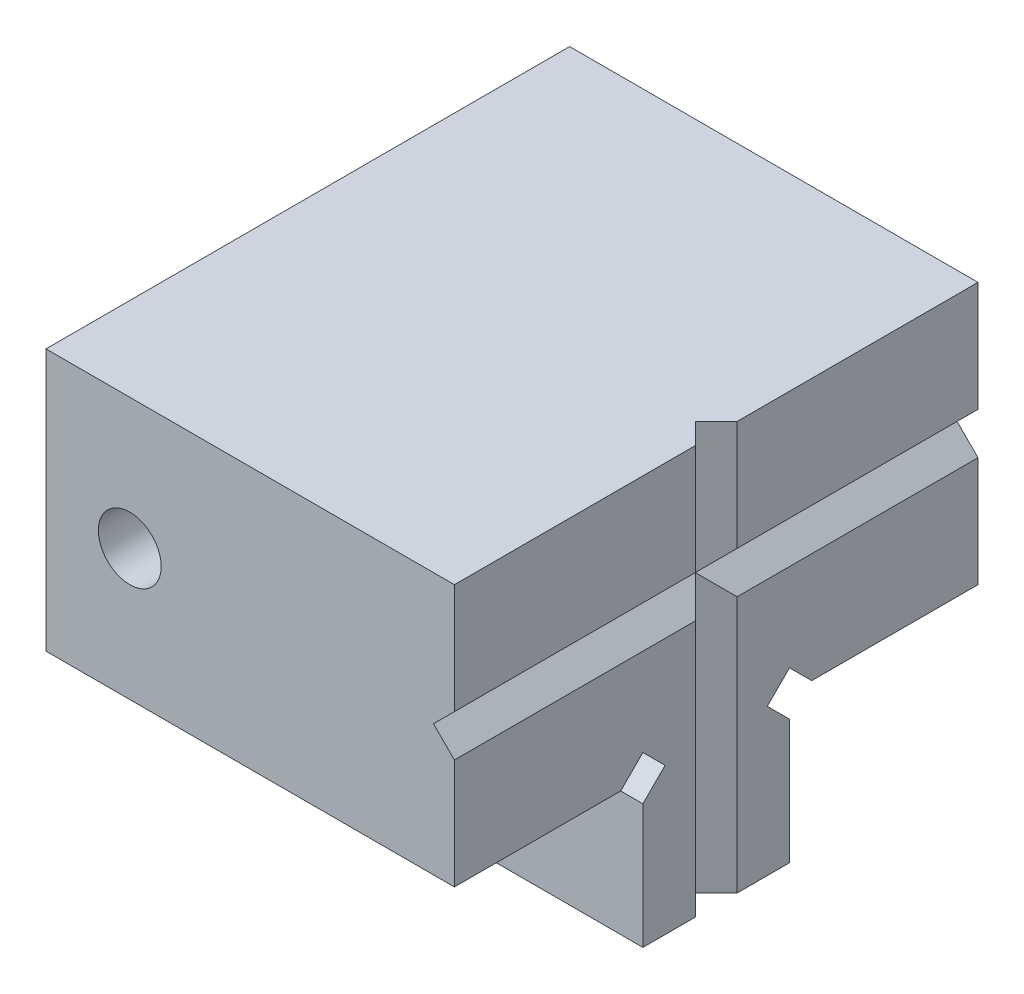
ISO-10303-21;
HEADER;
FILE_DESCRIPTION(('STEP AP214'),'2;1');
FILE_NAME('part.step','',(''),(''),'','','');
FILE_SCHEMA(('AUTOMOTIVE_DESIGN { 1 0 10303 214 1 1 1 1 }'));
ENDSEC;
DATA;
#1=APPLICATION_CONTEXT('core data for automotive mechanical design processes');
#2=APPLICATION_PROTOCOL_DEFINITION('international standard','automotive_design',2000,#1);
#3=PRODUCT_CONTEXT('',#1,'mechanical');
#4=PRODUCT('Part','Part','',(#3));
#5=PRODUCT_RELATED_PRODUCT_CATEGORY('part','',(#4));
#6=PRODUCT_DEFINITION_FORMATION('','',#4);
#7=PRODUCT_DEFINITION_CONTEXT('part definition',#1,'design');
#8=PRODUCT_DEFINITION('design','',#6,#7);
#9=PRODUCT_DEFINITION_SHAPE('','',#8);
#10=(LENGTH_UNIT() NAMED_UNIT(*) SI_UNIT(.MILLI.,.METRE.));
#11=(NAMED_UNIT(*) PLANE_ANGLE_UNIT() SI_UNIT($,.RADIAN.));
#12=(NAMED_UNIT(*) SI_UNIT($,.STERADIAN.) SOLID_ANGLE_UNIT());
#13=UNCERTAINTY_MEASURE_WITH_UNIT(LENGTH_MEASURE(1.E-05),#10,'distance_accuracy_value','');
#14=(GEOMETRIC_REPRESENTATION_CONTEXT(3) GLOBAL_UNCERTAINTY_ASSIGNED_CONTEXT((#13)) GLOBAL_UNIT_ASSIGNED_CONTEXT((#10,
#11,#12)) REPRESENTATION_CONTEXT('',''));
#15=CARTESIAN_POINT('',(0.,0.,0.));
#16=DIRECTION('',(0.,0.,1.));
#17=DIRECTION('',(1.,0.,0.));
#18=AXIS2_PLACEMENT_3D('',#15,#16,#17);
#19=CARTESIAN_POINT('',(-31.,26.5,25.));
#20=DIRECTION('',(0.,0.,-1.));
#21=DIRECTION('',(0.,1.,0.));
#22=AXIS2_PLACEMENT_3D('',#19,#20,#21);
#23=CYLINDRICAL_SURFACE('',#22,2.99999999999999);
#24=CARTESIAN_POINT('',(-31.,29.5,5.19615242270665));
#25=CARTESIAN_POINT('',(-30.9217997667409,29.4999991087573,5.19615338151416));
#26=CARTESIAN_POINT('',(-30.8435900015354,29.4969361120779,5.19792581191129));
#27=CARTESIAN_POINT('',(-30.6877919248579,29.484735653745,5.20493931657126));
#28=CARTESIAN_POINT('',(-30.6102039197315,29.4755953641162,5.21018200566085));
#29=CARTESIAN_POINT('',(-30.3790559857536,29.4391691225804,5.2308820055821));
#30=CARTESIAN_POINT('',(-30.2272490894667,29.402878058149,5.25131076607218));
#31=CARTESIAN_POINT('',(-29.9336083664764,29.3082999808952,5.30247746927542));
#32=CARTESIAN_POINT('',(-29.7917261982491,29.2501298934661,5.33316051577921));
#33=CARTESIAN_POINT('',(-29.5197372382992,29.1138025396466,5.40128072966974));
#34=CARTESIAN_POINT('',(-29.3896310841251,29.0356441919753,5.43871826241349));
#35=CARTESIAN_POINT('',(-29.1330798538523,28.8539996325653,5.5199058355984));
#36=CARTESIAN_POINT('',(-29.0078217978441,28.7489561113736,5.56392184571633));
#37=CARTESIAN_POINT('',(-28.7757756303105,28.5197614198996,5.65115954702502));
#38=CARTESIAN_POINT('',(-28.6689967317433,28.3956007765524,5.69438083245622));
#39=CARTESIAN_POINT('',(-28.4698983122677,28.1214686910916,5.77864428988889));
#40=CARTESIAN_POINT('',(-28.3790386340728,27.9703215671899,5.81934318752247));
#41=CARTESIAN_POINT('',(-28.2245775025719,27.6524710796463,5.89052268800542));
#42=CARTESIAN_POINT('',(-28.1609588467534,27.485777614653,5.92100973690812));
#43=CARTESIAN_POINT('',(-28.0674860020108,27.1541348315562,5.96641383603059));
#44=CARTESIAN_POINT('',(-28.035551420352,26.9899053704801,5.98228440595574));
#45=CARTESIAN_POINT('',(-27.999501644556,26.6577118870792,6.00022751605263));
#46=CARTESIAN_POINT('',(-27.9953696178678,26.4897501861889,6.00230840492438));
#47=CARTESIAN_POINT('',(-28.0142400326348,26.170502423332,5.9928894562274));
#48=CARTESIAN_POINT('',(-28.0349140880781,26.0190363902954,5.98255487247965));
#49=CARTESIAN_POINT('',(-28.0986424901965,25.7220586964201,5.9512273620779));
#50=CARTESIAN_POINT('',(-28.1416985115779,25.5765474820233,5.93023363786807));
#51=CARTESIAN_POINT('',(-28.2492478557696,25.2930717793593,5.87914748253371));
#52=CARTESIAN_POINT('',(-28.3140295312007,25.1552395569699,5.84893318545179));
#53=CARTESIAN_POINT('',(-28.462789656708,24.8920697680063,5.78212944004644));
#54=CARTESIAN_POINT('',(-28.5467749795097,24.766736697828,5.74553771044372));
#55=CARTESIAN_POINT('',(-28.7406884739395,24.5194783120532,5.665331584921));
#56=CARTESIAN_POINT('',(-28.8523185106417,24.3989950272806,5.62138031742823));
#57=CARTESIAN_POINT('',(-29.0937597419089,24.177689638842,5.53363118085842));
#58=CARTESIAN_POINT('',(-29.2235847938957,24.0768826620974,5.48983345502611));
#59=CARTESIAN_POINT('',(-29.5079821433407,23.8914730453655,5.40432084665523));
#60=CARTESIAN_POINT('',(-29.663602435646,23.808305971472,5.36291485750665));
#61=CARTESIAN_POINT('',(-29.9075630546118,23.704571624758,5.30915194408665));
#62=CARTESIAN_POINT('',(-29.9906563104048,23.67349202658,5.29261946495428));
#63=CARTESIAN_POINT('',(-30.1598086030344,23.6186870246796,5.26298473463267));
#64=CARTESIAN_POINT('',(-30.2458657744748,23.5949570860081,5.24988036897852));
#65=CARTESIAN_POINT('',(-30.413371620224,23.5567607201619,5.22855455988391));
#66=CARTESIAN_POINT('',(-30.4946494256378,23.5417118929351,5.22002982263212));
#67=CARTESIAN_POINT('',(-30.6584352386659,23.5183609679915,5.20672737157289));
#68=CARTESIAN_POINT('',(-30.7409425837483,23.5100553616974,5.20194770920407));
#69=CARTESIAN_POINT('',(-30.9064710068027,23.5003133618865,5.19633662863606));
#70=CARTESIAN_POINT('',(-30.9894918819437,23.4988744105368,5.1955037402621));
#71=CARTESIAN_POINT('',(-31.1552864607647,23.5028725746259,5.19780953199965));
#72=CARTESIAN_POINT('',(-31.2380601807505,23.508309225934,5.20094794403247));
#73=CARTESIAN_POINT('',(-31.4668591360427,23.5328986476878,5.21504493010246));
#74=CARTESIAN_POINT('',(-31.6119108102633,23.5594383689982,5.23019160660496));
#75=CARTESIAN_POINT('',(-31.8951309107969,23.6329093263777,5.27081666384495));
#76=CARTESIAN_POINT('',(-32.0332970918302,23.6798471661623,5.29629839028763));
#77=CARTESIAN_POINT('',(-32.3062261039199,23.7950577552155,5.3560878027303));
#78=CARTESIAN_POINT('',(-32.4405349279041,23.8642179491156,5.39074960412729));
#79=CARTESIAN_POINT('',(-32.696409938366,24.0211386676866,5.46468327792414));
#80=CARTESIAN_POINT('',(-32.8179695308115,24.1089087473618,5.50395751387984));
#81=CARTESIAN_POINT('',(-33.0609356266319,24.313488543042,5.588640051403));
#82=CARTESIAN_POINT('',(-33.1803912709,24.432564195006,5.63419752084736));
#83=CARTESIAN_POINT('',(-33.3982368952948,24.6897865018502,5.72202702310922));
#84=CARTESIAN_POINT('',(-33.4966197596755,24.8279395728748,5.76429794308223));
#85=CARTESIAN_POINT('',(-33.6717211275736,25.1243939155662,5.84224085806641));
#86=CARTESIAN_POINT('',(-33.7477993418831,25.2831307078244,5.87770925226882));
#87=CARTESIAN_POINT('',(-33.8714137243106,25.6134329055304,5.93650064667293));
#88=CARTESIAN_POINT('',(-33.9189749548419,25.784986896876,5.95983430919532));
#89=CARTESIAN_POINT('',(-33.9801056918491,26.1190609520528,5.9900252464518));
#90=CARTESIAN_POINT('',(-33.9963936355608,26.2809656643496,5.99819783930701));
#91=CARTESIAN_POINT('',(-34.0025297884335,26.6053779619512,6.00126390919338));
#92=CARTESIAN_POINT('',(-33.9923872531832,26.7678853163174,5.99616203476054));
#93=CARTESIAN_POINT('',(-33.9477508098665,27.0776139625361,5.97401907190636));
#94=CARTESIAN_POINT('',(-33.9149055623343,27.2251369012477,5.95778686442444));
#95=CARTESIAN_POINT('',(-33.8280188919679,27.5123379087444,5.91576278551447));
#96=CARTESIAN_POINT('',(-33.7739744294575,27.6520148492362,5.88996954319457));
#97=CARTESIAN_POINT('',(-33.6438192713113,27.9262700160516,5.82977801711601));
#98=CARTESIAN_POINT('',(-33.5668636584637,28.0603746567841,5.79505887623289));
#99=CARTESIAN_POINT('',(-33.3941245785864,28.314324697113,5.72064363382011));
#100=CARTESIAN_POINT('',(-33.2983324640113,28.4341635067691,5.68094524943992));
#101=CARTESIAN_POINT('',(-33.0796152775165,28.6687388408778,5.59585978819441));
#102=CARTESIAN_POINT('',(-32.9549386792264,28.7817806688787,5.5502997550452));
#103=CARTESIAN_POINT('',(-32.6876216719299,28.9860022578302,5.46188649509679));
#104=CARTESIAN_POINT('',(-32.5449655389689,29.077162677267,5.41903568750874));
#105=CARTESIAN_POINT('',(-32.3174682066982,29.1966555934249,5.36004774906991));
#106=CARTESIAN_POINT('',(-32.2380241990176,29.2340540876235,5.34101219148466));
#107=CARTESIAN_POINT('',(-32.0756467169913,29.301912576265,5.30572783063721));
#108=CARTESIAN_POINT('',(-31.992715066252,29.3323761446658,5.28947759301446));
#109=CARTESIAN_POINT('',(-31.8241552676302,29.3859262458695,5.26045215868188));
#110=CARTESIAN_POINT('',(-31.7385346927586,29.4090317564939,5.24766803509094));
#111=CARTESIAN_POINT('',(-31.5651447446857,29.4476242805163,5.22608869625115));
#112=CARTESIAN_POINT('',(-31.4773769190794,29.4631166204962,5.21729069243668));
#113=CARTESIAN_POINT('',(-31.3246011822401,29.4830938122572,5.20588528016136));
#114=CARTESIAN_POINT('',(-31.259905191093,29.4894274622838,5.20224442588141));
#115=CARTESIAN_POINT('',(-31.1301416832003,29.4978810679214,5.19737751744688));
#116=CARTESIAN_POINT('',(-31.0650741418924,29.5000007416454,5.19615162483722));
#117=CARTESIAN_POINT('',(-31.,29.5,5.19615242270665));
#118=B_SPLINE_CURVE_WITH_KNOTS('',3,(#24,#25,#26,#27,#28,#29,#30,#31,#32,#33,#34,#35,#36,#37,
#38,#39,#40,#41,#42,#43,#44,#45,#46,#47,#48,#49,#50,#51,#52,#53,#54,#55,#56,#57,#58,#59,#60,#61,
#62,#63,#64,#65,#66,#67,#68,#69,#70,#71,#72,#73,#74,#75,#76,#77,#78,#79,#80,#81,#82,#83,#84,#85,
#86,#87,#88,#89,#90,#91,#92,#93,#94,#95,#96,#97,#98,#99,#100,#101,#102,#103,#104,#105,#106,#107,
#108,#109,#110,#111,#112,#113,#114,#115,#116,#117),.UNSPECIFIED.,.T.,.F.,(4,2,2,2,2,2,2,2,2,2,2,
2,2,2,2,2,2,2,2,2,2,2,2,2,2,2,2,2,2,2,2,2,2,2,2,2,2,2,2,2,2,2,2,2,2,2,4),(0.,0.234529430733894,
0.469168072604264,0.938850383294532,1.40605749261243,1.87328988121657,2.37905864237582,
2.88507883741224,3.42520847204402,3.96499651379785,4.46637625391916,4.9674524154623,
5.42495462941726,5.88249108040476,6.34635774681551,6.81039068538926,7.31828744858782,
7.82657315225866,8.36713695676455,8.63752916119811,8.90775419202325,9.1566960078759,
9.40550821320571,9.65422772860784,9.90293045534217,10.3454331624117,10.7880792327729,
11.2512265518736,11.7146122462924,12.2364099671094,12.758383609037,13.2941331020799,
13.8294110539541,14.3155757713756,14.8015702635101,15.2555404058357,15.7095756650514,
16.1830301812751,16.6567025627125,17.177514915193,17.6987859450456,17.9680115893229,
18.2370981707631,18.5054849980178,18.7736837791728,18.9688338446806,19.1639969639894),.UNSPECIFIED.);
#119=CARTESIAN_POINT('',(-31.,29.5,5.19615242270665));
#120=VERTEX_POINT('',#119);
#121=EDGE_CURVE('E41',#120,#120,#118,.T.);
#122=ORIENTED_EDGE('',*,*,#121,.T.);
#123=EDGE_LOOP('',(#122));
#124=FACE_BOUND('',#123,.T.);
#125=CARTESIAN_POINT('',(-31.,26.5,25.));
#126=DIRECTION('',(0.,0.,-1.));
#127=DIRECTION('',(0.,1.,0.));
#128=AXIS2_PLACEMENT_3D('',#125,#126,#127);
#129=CIRCLE('',#128,2.99999999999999);
#130=CARTESIAN_POINT('',(-31.,29.5,25.));
#131=VERTEX_POINT('',#130);
#132=EDGE_CURVE('E230',#131,#131,#129,.T.);
#133=ORIENTED_EDGE('',*,*,#132,.F.);
#134=EDGE_LOOP('',(#133));
#135=FACE_BOUND('',#134,.T.);
#136=ADVANCED_FACE('F37',(#124,#135),#23,.F.);
#137=CARTESIAN_POINT('',(0.,0.,0.));
#138=DIRECTION('',(-1.,0.,0.));
#139=DIRECTION('',(0.,0.,1.));
#140=AXIS2_PLACEMENT_3D('',#137,#138,#139);
#141=PLANE('',#140);
#142=DIRECTION('',(0.,0.,1.));
#143=VECTOR('',#142,1.);
#144=CARTESIAN_POINT('',(0.,24.5,-25.));
#145=LINE('',#144,#143);
#146=CARTESIAN_POINT('',(0.,24.5,-25.));
#147=VERTEX_POINT('',#146);
#148=CARTESIAN_POINT('',(0.,24.5,-2.));
#149=VERTEX_POINT('',#148);
#150=EDGE_CURVE('E259',#147,#149,#145,.T.);
#151=ORIENTED_EDGE('',*,*,#150,.T.);
#152=DIRECTION('',(0.,1.,0.));
#153=VECTOR('',#152,1.);
#154=CARTESIAN_POINT('',(0.,0.,-2.));
#155=LINE('',#154,#153);
#156=CARTESIAN_POINT('',(0.,0.,-2.));
#157=VERTEX_POINT('',#156);
#158=EDGE_CURVE('E232',#157,#149,#155,.T.);
#159=ORIENTED_EDGE('',*,*,#158,.F.);
#160=DIRECTION('',(0.,0.,-1.));
#161=VECTOR('',#160,1.);
#162=CARTESIAN_POINT('',(0.,0.,7.));
#163=LINE('',#162,#161);
#164=CARTESIAN_POINT('',(0.,0.,-7.));
#165=VERTEX_POINT('',#164);
#166=EDGE_CURVE('E220',#157,#165,#163,.T.);
#167=ORIENTED_EDGE('',*,*,#166,.T.);
#168=DIRECTION('',(0.,1.,0.));
#169=VECTOR('',#168,1.);
#170=CARTESIAN_POINT('',(0.,0.,-7.));
#171=LINE('',#170,#169);
#172=CARTESIAN_POINT('',(0.,11.8786796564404,-7.));
#173=VERTEX_POINT('',#172);
#174=EDGE_CURVE('E334',#165,#173,#171,.T.);
#175=ORIENTED_EDGE('',*,*,#174,.T.);
#176=DIRECTION('',(0.,0.707106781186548,0.707106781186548));
#177=VECTOR('',#176,1.);
#178=CARTESIAN_POINT('',(0.,11.8786796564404,-7.));
#179=LINE('',#178,#177);
#180=CARTESIAN_POINT('',(0.,14.,-4.87867965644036));
#181=VERTEX_POINT('',#180);
#182=EDGE_CURVE('E337',#173,#181,#179,.T.);
#183=ORIENTED_EDGE('',*,*,#182,.T.);
#184=DIRECTION('',(0.,0.707106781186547,-0.707106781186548));
#185=VECTOR('',#184,1.);
#186=CARTESIAN_POINT('',(0.,14.,-4.87867965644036));
#187=LINE('',#186,#185);
#188=CARTESIAN_POINT('',(0.,16.1213203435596,-7.));
#189=VERTEX_POINT('',#188);
#190=EDGE_CURVE('E340',#181,#189,#187,.T.);
#191=ORIENTED_EDGE('',*,*,#190,.T.);
#192=DIRECTION('',(0.,-0.707106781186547,-0.707106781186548));
#193=VECTOR('',#192,1.);
#194=CARTESIAN_POINT('',(0.,16.1213203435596,-7.));
#195=LINE('',#194,#193);
#196=CARTESIAN_POINT('',(0.,14.,-9.12132034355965));
#197=VERTEX_POINT('',#196);
#198=EDGE_CURVE('E343',#189,#197,#195,.T.);
#199=ORIENTED_EDGE('',*,*,#198,.T.);
#200=DIRECTION('',(0.,0.,-1.));
#201=VECTOR('',#200,1.);
#202=CARTESIAN_POINT('',(0.,14.,-9.12132034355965));
#203=LINE('',#202,#201);
#204=CARTESIAN_POINT('',(0.,14.,-25.));
#205=VERTEX_POINT('',#204);
#206=EDGE_CURVE('E266',#197,#205,#203,.T.);
#207=ORIENTED_EDGE('',*,*,#206,.T.);
#208=DIRECTION('',(0.,1.,0.));
#209=VECTOR('',#208,1.);
#210=CARTESIAN_POINT('',(0.,14.,-25.));
#211=LINE('',#210,#209);
#212=EDGE_CURVE('E306',#205,#147,#211,.T.);
#213=ORIENTED_EDGE('',*,*,#212,.T.);
#214=EDGE_LOOP('',(#151,#159,#167,#175,#183,#191,#199,#207,#213));
#215=FACE_BOUND('',#214,.T.);
#216=ADVANCED_FACE('F409',(#215),#141,.F.);
#217=DIRECTION('',(0.,0.,1.));
#218=VECTOR('',#217,1.);
#219=CARTESIAN_POINT('',(0.,39.,25.));
#220=LINE('',#219,#218);
#221=CARTESIAN_POINT('',(0.,39.,-25.));
#222=VERTEX_POINT('',#221);
#223=CARTESIAN_POINT('',(0.,39.,-2.));
#224=VERTEX_POINT('',#223);
#225=EDGE_CURVE('E310',#222,#224,#220,.T.);
#226=ORIENTED_EDGE('',*,*,#225,.T.);
#227=CARTESIAN_POINT('',(0.,28.5,-2.));
#228=VERTEX_POINT('',#227);
#229=EDGE_CURVE('E235',#228,#224,#155,.T.);
#230=ORIENTED_EDGE('',*,*,#229,.F.);
#231=DIRECTION('',(0.,0.,1.));
#232=VECTOR('',#231,1.);
#233=CARTESIAN_POINT('',(0.,28.5,-25.));
#234=LINE('',#233,#232);
#235=CARTESIAN_POINT('',(0.,28.5,-25.));
#236=VERTEX_POINT('',#235);
#237=EDGE_CURVE('E256',#236,#228,#234,.T.);
#238=ORIENTED_EDGE('',*,*,#237,.F.);
#239=EDGE_CURVE('E254',#236,#222,#211,.T.);
#240=ORIENTED_EDGE('',*,*,#239,.T.);
#241=EDGE_LOOP('',(#226,#230,#238,#240));
#242=FACE_BOUND('',#241,.T.);
#243=ADVANCED_FACE('F414',(#242),#141,.F.);
#244=CARTESIAN_POINT('',(-2.00000000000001,26.5,-25.));
#245=DIRECTION('',(-0.707106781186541,-0.707106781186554,0.));
#246=DIRECTION('',(0.707106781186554,-0.707106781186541,0.));
#247=AXIS2_PLACEMENT_3D('',#244,#245,#246);
#248=PLANE('',#247);
#249=DIRECTION('',(0.,0.,1.));
#250=VECTOR('',#249,1.);
#251=CARTESIAN_POINT('',(-2.00000000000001,26.5,-25.));
#252=LINE('',#251,#250);
#253=CARTESIAN_POINT('',(-2.00000000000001,26.5,-25.));
#254=VERTEX_POINT('',#253);
#255=CARTESIAN_POINT('',(-2.00000000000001,26.5,0.));
#256=VERTEX_POINT('',#255);
#257=EDGE_CURVE('E251',#254,#256,#252,.T.);
#258=ORIENTED_EDGE('',*,*,#257,.T.);
#259=DIRECTION('',(0.577350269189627,-0.577350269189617,-0.577350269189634));
#260=VECTOR('',#259,1.);
#261=CARTESIAN_POINT('',(6.33333333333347,18.1666666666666,-8.33333333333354));
#262=LINE('',#261,#260);
#263=EDGE_CURVE('E204',#256,#149,#262,.T.);
#264=ORIENTED_EDGE('',*,*,#263,.T.);
#265=ORIENTED_EDGE('',*,*,#150,.F.);
#266=DIRECTION('',(0.707106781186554,-0.707106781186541,0.));
#267=VECTOR('',#266,1.);
#268=CARTESIAN_POINT('',(-2.00000000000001,26.5,-25.));
#269=LINE('',#268,#267);
#270=EDGE_CURVE('E241',#254,#147,#269,.T.);
#271=ORIENTED_EDGE('',*,*,#270,.F.);
#272=EDGE_LOOP('',(#258,#264,#265,#271));
#273=FACE_BOUND('',#272,.T.);
#274=ADVANCED_FACE('F577',(#273),#248,.F.);
#275=CARTESIAN_POINT('',(0.,28.5,-25.));
#276=DIRECTION('',(-0.707106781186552,0.707106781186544,0.));
#277=DIRECTION('',(-0.707106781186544,-0.707106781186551,0.));
#278=AXIS2_PLACEMENT_3D('',#275,#276,#277);
#279=PLANE('',#278);
#280=ORIENTED_EDGE('',*,*,#237,.T.);
#281=DIRECTION('',(-0.577350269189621,-0.577350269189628,0.577350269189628));
#282=VECTOR('',#281,1.);
#283=CARTESIAN_POINT('',(7.66666666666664,36.1666666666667,-9.66666666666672));
#284=LINE('',#283,#282);
#285=EDGE_CURVE('E11',#228,#256,#284,.T.);
#286=ORIENTED_EDGE('',*,*,#285,.T.);
#287=ORIENTED_EDGE('',*,*,#257,.F.);
#288=DIRECTION('',(-0.707106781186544,-0.707106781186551,0.));
#289=VECTOR('',#288,1.);
#290=CARTESIAN_POINT('',(0.,28.5,-25.));
#291=LINE('',#290,#289);
#292=EDGE_CURVE('E67',#236,#254,#291,.T.);
#293=ORIENTED_EDGE('',*,*,#292,.F.);
#294=EDGE_LOOP('',(#280,#286,#287,#293));
#295=FACE_BOUND('',#294,.T.);
#296=ADVANCED_FACE('F565',(#295),#279,.F.);
#297=CARTESIAN_POINT('',(0.,0.,7.));
#298=VERTEX_POINT('',#297);
#299=CARTESIAN_POINT('',(0.,0.,2.));
#300=VERTEX_POINT('',#299);
#301=EDGE_CURVE('E332',#298,#300,#163,.T.);
#302=ORIENTED_EDGE('',*,*,#301,.T.);
#303=DIRECTION('',(0.,1.,0.));
#304=VECTOR('',#303,1.);
#305=CARTESIAN_POINT('',(0.,0.,2.));
#306=LINE('',#305,#304);
#307=CARTESIAN_POINT('',(0.,24.5,2.));
#308=VERTEX_POINT('',#307);
#309=EDGE_CURVE('E212',#300,#308,#306,.T.);
#310=ORIENTED_EDGE('',*,*,#309,.T.);
#311=CARTESIAN_POINT('',(0.,24.5,25.));
#312=VERTEX_POINT('',#311);
#313=EDGE_CURVE('E246',#308,#312,#145,.T.);
#314=ORIENTED_EDGE('',*,*,#313,.T.);
#315=DIRECTION('',(0.,-1.,0.));
#316=VECTOR('',#315,1.);
#317=CARTESIAN_POINT('',(0.,14.,25.));
#318=LINE('',#317,#316);
#319=CARTESIAN_POINT('',(0.,14.,25.));
#320=VERTEX_POINT('',#319);
#321=EDGE_CURVE('E313',#312,#320,#318,.T.);
#322=ORIENTED_EDGE('',*,*,#321,.T.);
#323=DIRECTION('',(0.,0.,-1.));
#324=VECTOR('',#323,1.);
#325=CARTESIAN_POINT('',(0.,14.,9.12132034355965));
#326=LINE('',#325,#324);
#327=CARTESIAN_POINT('',(0.,14.,9.12132034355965));
#328=VERTEX_POINT('',#327);
#329=EDGE_CURVE('E317',#320,#328,#326,.T.);
#330=ORIENTED_EDGE('',*,*,#329,.T.);
#331=DIRECTION('',(0.,0.707106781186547,-0.707106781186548));
#332=VECTOR('',#331,1.);
#333=CARTESIAN_POINT('',(0.,16.1213203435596,7.));
#334=LINE('',#333,#332);
#335=CARTESIAN_POINT('',(0.,16.1213203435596,7.));
#336=VERTEX_POINT('',#335);
#337=EDGE_CURVE('E320',#328,#336,#334,.T.);
#338=ORIENTED_EDGE('',*,*,#337,.T.);
#339=DIRECTION('',(0.,-0.707106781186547,-0.707106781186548));
#340=VECTOR('',#339,1.);
#341=CARTESIAN_POINT('',(0.,14.,4.87867965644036));
#342=LINE('',#341,#340);
#343=CARTESIAN_POINT('',(0.,14.,4.87867965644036));
#344=VERTEX_POINT('',#343);
#345=EDGE_CURVE('E323',#336,#344,#342,.T.);
#346=ORIENTED_EDGE('',*,*,#345,.T.);
#347=DIRECTION('',(0.,-0.707106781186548,0.707106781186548));
#348=VECTOR('',#347,1.);
#349=CARTESIAN_POINT('',(0.,11.8786796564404,7.));
#350=LINE('',#349,#348);
#351=CARTESIAN_POINT('',(0.,11.8786796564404,7.));
#352=VERTEX_POINT('',#351);
#353=EDGE_CURVE('E326',#344,#352,#350,.T.);
#354=ORIENTED_EDGE('',*,*,#353,.T.);
#355=DIRECTION('',(0.,-1.,0.));
#356=VECTOR('',#355,1.);
#357=CARTESIAN_POINT('',(0.,0.,7.));
#358=LINE('',#357,#356);
#359=EDGE_CURVE('E329',#352,#298,#358,.T.);
#360=ORIENTED_EDGE('',*,*,#359,.T.);
#361=EDGE_LOOP('',(#302,#310,#314,#322,#330,#338,#346,#354,#360));
#362=FACE_BOUND('',#361,.T.);
#363=ADVANCED_FACE('F513',(#362),#141,.F.);
#364=CARTESIAN_POINT('',(-39.,14.,-25.));
#365=DIRECTION('',(0.,0.,-1.));
#366=DIRECTION('',(0.,1.,0.));
#367=AXIS2_PLACEMENT_3D('',#364,#365,#366);
#368=PLANE('',#367);
#369=CARTESIAN_POINT('',(-31.,26.5,-25.));
#370=DIRECTION('',(0.,0.,-1.));
#371=DIRECTION('',(0.,1.,0.));
#372=AXIS2_PLACEMENT_3D('',#369,#370,#371);
#373=CIRCLE('',#372,2.99999999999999);
#374=CARTESIAN_POINT('',(-31.,29.5,-25.));
#375=VERTEX_POINT('',#374);
#376=EDGE_CURVE('E226',#375,#375,#373,.T.);
#377=ORIENTED_EDGE('',*,*,#376,.F.);
#378=EDGE_LOOP('',(#377));
#379=FACE_BOUND('',#378,.T.);
#380=ORIENTED_EDGE('',*,*,#270,.T.);
#381=ORIENTED_EDGE('',*,*,#212,.F.);
#382=DIRECTION('',(1.,0.,0.));
#383=VECTOR('',#382,1.);
#384=CARTESIAN_POINT('',(-39.,14.,-25.));
#385=LINE('',#384,#383);
#386=CARTESIAN_POINT('',(-39.,14.,-25.));
#387=VERTEX_POINT('',#386);
#388=EDGE_CURVE('E348',#387,#205,#385,.T.);
#389=ORIENTED_EDGE('',*,*,#388,.F.);
#390=DIRECTION('',(0.,1.,0.));
#391=VECTOR('',#390,1.);
#392=CARTESIAN_POINT('',(-39.,14.,-25.));
#393=LINE('',#392,#391);
#394=CARTESIAN_POINT('',(-39.,39.,-25.));
#395=VERTEX_POINT('',#394);
#396=EDGE_CURVE('E262',#387,#395,#393,.T.);
#397=ORIENTED_EDGE('',*,*,#396,.T.);
#398=DIRECTION('',(1.,0.,0.));
#399=VECTOR('',#398,1.);
#400=CARTESIAN_POINT('',(-39.,39.,-25.));
#401=LINE('',#400,#399);
#402=EDGE_CURVE('E305',#395,#222,#401,.T.);
#403=ORIENTED_EDGE('',*,*,#402,.T.);
#404=ORIENTED_EDGE('',*,*,#239,.F.);
#405=ORIENTED_EDGE('',*,*,#292,.T.);
#406=EDGE_LOOP('',(#380,#381,#389,#397,#403,#404,#405));
#407=FACE_BOUND('',#406,.T.);
#408=ADVANCED_FACE('F39',(#379,#407),#368,.T.);
#409=CARTESIAN_POINT('',(-39.,14.,-9.12132034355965));
#410=DIRECTION('',(0.,-1.,0.));
#411=DIRECTION('',(0.,0.,-1.));
#412=AXIS2_PLACEMENT_3D('',#409,#410,#411);
#413=PLANE('',#412);
#414=ORIENTED_EDGE('',*,*,#206,.F.);
#415=DIRECTION('',(1.,0.,0.));
#416=VECTOR('',#415,1.);
#417=CARTESIAN_POINT('',(-39.,14.,-9.12132034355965));
#418=LINE('',#417,#416);
#419=CARTESIAN_POINT('',(-39.,14.,-9.12132034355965));
#420=VERTEX_POINT('',#419);
#421=EDGE_CURVE('E350',#420,#197,#418,.T.);
#422=ORIENTED_EDGE('',*,*,#421,.F.);
#423=DIRECTION('',(0.,0.,-1.));
#424=VECTOR('',#423,1.);
#425=CARTESIAN_POINT('',(-39.,14.,-9.12132034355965));
#426=LINE('',#425,#424);
#427=EDGE_CURVE('E302',#420,#387,#426,.T.);
#428=ORIENTED_EDGE('',*,*,#427,.T.);
#429=ORIENTED_EDGE('',*,*,#388,.T.);
#430=EDGE_LOOP('',(#414,#422,#428,#429));
#431=FACE_BOUND('',#430,.T.);
#432=ADVANCED_FACE('F512',(#431),#413,.T.);
#433=CARTESIAN_POINT('',(-39.,16.1213203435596,-7.));
#434=DIRECTION('',(0.,-0.707106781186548,0.707106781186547));
#435=DIRECTION('',(0.,-0.707106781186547,-0.707106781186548));
#436=AXIS2_PLACEMENT_3D('',#433,#434,#435);
#437=PLANE('',#436);
#438=ORIENTED_EDGE('',*,*,#198,.F.);
#439=DIRECTION('',(1.,0.,0.));
#440=VECTOR('',#439,1.);
#441=CARTESIAN_POINT('',(-39.,16.1213203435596,-7.));
#442=LINE('',#441,#440);
#443=CARTESIAN_POINT('',(-39.,16.1213203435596,-7.));
#444=VERTEX_POINT('',#443);
#445=EDGE_CURVE('E352',#444,#189,#442,.T.);
#446=ORIENTED_EDGE('',*,*,#445,.F.);
#447=DIRECTION('',(0.,-0.707106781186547,-0.707106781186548));
#448=VECTOR('',#447,1.);
#449=CARTESIAN_POINT('',(-39.,16.1213203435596,-7.));
#450=LINE('',#449,#448);
#451=EDGE_CURVE('E299',#444,#420,#450,.T.);
#452=ORIENTED_EDGE('',*,*,#451,.T.);
#453=ORIENTED_EDGE('',*,*,#421,.T.);
#454=EDGE_LOOP('',(#438,#446,#452,#453));
#455=FACE_BOUND('',#454,.T.);
#456=ADVANCED_FACE('F719',(#455),#437,.T.);
#457=CARTESIAN_POINT('',(-39.,14.,-4.87867965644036));
#458=DIRECTION('',(0.,-0.707106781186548,-0.707106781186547));
#459=DIRECTION('',(0.,0.707106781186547,-0.707106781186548));
#460=AXIS2_PLACEMENT_3D('',#457,#458,#459);
#461=PLANE('',#460);
#462=ORIENTED_EDGE('',*,*,#190,.F.);
#463=DIRECTION('',(1.,0.,0.));
#464=VECTOR('',#463,1.);
#465=CARTESIAN_POINT('',(-39.,14.,-4.87867965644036));
#466=LINE('',#465,#464);
#467=CARTESIAN_POINT('',(-39.,14.,-4.87867965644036));
#468=VERTEX_POINT('',#467);
#469=EDGE_CURVE('E354',#468,#181,#466,.T.);
#470=ORIENTED_EDGE('',*,*,#469,.F.);
#471=DIRECTION('',(0.,0.707106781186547,-0.707106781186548));
#472=VECTOR('',#471,1.);
#473=CARTESIAN_POINT('',(-39.,14.,-4.87867965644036));
#474=LINE('',#473,#472);
#475=EDGE_CURVE('E296',#468,#444,#474,.T.);
#476=ORIENTED_EDGE('',*,*,#475,.T.);
#477=ORIENTED_EDGE('',*,*,#445,.T.);
#478=EDGE_LOOP('',(#462,#470,#476,#477));
#479=FACE_BOUND('',#478,.T.);
#480=ADVANCED_FACE('F708',(#479),#461,.T.);
#481=CARTESIAN_POINT('',(-39.,11.8786796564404,-7.));
#482=DIRECTION('',(0.,0.707106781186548,-0.707106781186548));
#483=DIRECTION('',(0.,0.707106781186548,0.707106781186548));
#484=AXIS2_PLACEMENT_3D('',#481,#482,#483);
#485=PLANE('',#484);
#486=ORIENTED_EDGE('',*,*,#182,.F.);
#487=DIRECTION('',(1.,0.,0.));
#488=VECTOR('',#487,1.);
#489=CARTESIAN_POINT('',(-39.,11.8786796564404,-7.));
#490=LINE('',#489,#488);
#491=CARTESIAN_POINT('',(-39.,11.8786796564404,-7.));
#492=VERTEX_POINT('',#491);
#493=EDGE_CURVE('E356',#492,#173,#490,.T.);
#494=ORIENTED_EDGE('',*,*,#493,.F.);
#495=DIRECTION('',(0.,0.707106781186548,0.707106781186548));
#496=VECTOR('',#495,1.);
#497=CARTESIAN_POINT('',(-39.,11.8786796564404,-7.));
#498=LINE('',#497,#496);
#499=EDGE_CURVE('E293',#492,#468,#498,.T.);
#500=ORIENTED_EDGE('',*,*,#499,.T.);
#501=ORIENTED_EDGE('',*,*,#469,.T.);
#502=EDGE_LOOP('',(#486,#494,#500,#501));
#503=FACE_BOUND('',#502,.T.);
#504=ADVANCED_FACE('F697',(#503),#485,.T.);
#505=CARTESIAN_POINT('',(-39.,0.,-7.));
#506=DIRECTION('',(0.,0.,-1.));
#507=DIRECTION('',(-1.,0.,0.));
#508=AXIS2_PLACEMENT_3D('',#505,#506,#507);
#509=PLANE('',#508);
#510=ORIENTED_EDGE('',*,*,#174,.F.);
#511=DIRECTION('',(1.,0.,0.));
#512=VECTOR('',#511,1.);
#513=CARTESIAN_POINT('',(-39.,0.,-7.));
#514=LINE('',#513,#512);
#515=CARTESIAN_POINT('',(-39.,0.,-7.));
#516=VERTEX_POINT('',#515);
#517=EDGE_CURVE('E358',#516,#165,#514,.T.);
#518=ORIENTED_EDGE('',*,*,#517,.F.);
#519=DIRECTION('',(0.,1.,0.));
#520=VECTOR('',#519,1.);
#521=CARTESIAN_POINT('',(-39.,0.,-7.));
#522=LINE('',#521,#520);
#523=EDGE_CURVE('E290',#516,#492,#522,.T.);
#524=ORIENTED_EDGE('',*,*,#523,.T.);
#525=ORIENTED_EDGE('',*,*,#493,.T.);
#526=EDGE_LOOP('',(#510,#518,#524,#525));
#527=FACE_BOUND('',#526,.T.);
#528=ADVANCED_FACE('F602',(#527),#509,.T.);
#529=CARTESIAN_POINT('',(-39.,0.,7.));
#530=DIRECTION('',(0.,-1.,0.));
#531=DIRECTION('',(0.,0.,-1.));
#532=AXIS2_PLACEMENT_3D('',#529,#530,#531);
#533=PLANE('',#532);
#534=DIRECTION('',(-0.707106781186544,0.,0.707106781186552));
#535=VECTOR('',#534,1.);
#536=CARTESIAN_POINT('',(-2.00000000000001,0.,0.));
#537=LINE('',#536,#535);
#538=CARTESIAN_POINT('',(-2.00000000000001,0.,0.));
#539=VERTEX_POINT('',#538);
#540=EDGE_CURVE('E201',#157,#539,#537,.T.);
#541=ORIENTED_EDGE('',*,*,#540,.T.);
#542=DIRECTION('',(0.707106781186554,0.,0.707106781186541));
#543=VECTOR('',#542,1.);
#544=CARTESIAN_POINT('',(0.,0.,2.));
#545=LINE('',#544,#543);
#546=EDGE_CURVE('E209',#539,#300,#545,.T.);
#547=ORIENTED_EDGE('',*,*,#546,.T.);
#548=ORIENTED_EDGE('',*,*,#301,.F.);
#549=DIRECTION('',(1.,0.,0.));
#550=VECTOR('',#549,1.);
#551=CARTESIAN_POINT('',(-39.,0.,7.));
#552=LINE('',#551,#550);
#553=CARTESIAN_POINT('',(-39.,0.,7.));
#554=VERTEX_POINT('',#553);
#555=EDGE_CURVE('E360',#554,#298,#552,.T.);
#556=ORIENTED_EDGE('',*,*,#555,.F.);
#557=DIRECTION('',(0.,0.,-1.));
#558=VECTOR('',#557,1.);
#559=CARTESIAN_POINT('',(-39.,0.,7.));
#560=LINE('',#559,#558);
#561=EDGE_CURVE('E287',#554,#516,#560,.T.);
#562=ORIENTED_EDGE('',*,*,#561,.T.);
#563=ORIENTED_EDGE('',*,*,#517,.T.);
#564=ORIENTED_EDGE('',*,*,#166,.F.);
#565=EDGE_LOOP('',(#541,#547,#548,#556,#562,#563,#564));
#566=FACE_BOUND('',#565,.T.);
#567=ADVANCED_FACE('F218',(#566),#533,.T.);
#568=CARTESIAN_POINT('',(-39.,0.,7.));
#569=DIRECTION('',(0.,0.,1.));
#570=DIRECTION('',(1.,0.,0.));
#571=AXIS2_PLACEMENT_3D('',#568,#569,#570);
#572=PLANE('',#571);
#573=ORIENTED_EDGE('',*,*,#359,.F.);
#574=DIRECTION('',(1.,0.,0.));
#575=VECTOR('',#574,1.);
#576=CARTESIAN_POINT('',(-39.,11.8786796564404,7.));
#577=LINE('',#576,#575);
#578=CARTESIAN_POINT('',(-39.,11.8786796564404,7.));
#579=VERTEX_POINT('',#578);
#580=EDGE_CURVE('E362',#579,#352,#577,.T.);
#581=ORIENTED_EDGE('',*,*,#580,.F.);
#582=DIRECTION('',(0.,-1.,0.));
#583=VECTOR('',#582,1.);
#584=CARTESIAN_POINT('',(-39.,0.,7.));
#585=LINE('',#584,#583);
#586=EDGE_CURVE('E284',#579,#554,#585,.T.);
#587=ORIENTED_EDGE('',*,*,#586,.T.);
#588=ORIENTED_EDGE('',*,*,#555,.T.);
#589=EDGE_LOOP('',(#573,#581,#587,#588));
#590=FACE_BOUND('',#589,.T.);
#591=ADVANCED_FACE('F601',(#590),#572,.T.);
#592=CARTESIAN_POINT('',(-39.,11.8786796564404,7.));
#593=DIRECTION('',(0.,0.707106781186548,0.707106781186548));
#594=DIRECTION('',(0.,-0.707106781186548,0.707106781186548));
#595=AXIS2_PLACEMENT_3D('',#592,#593,#594);
#596=PLANE('',#595);
#597=ORIENTED_EDGE('',*,*,#353,.F.);
#598=DIRECTION('',(1.,0.,0.));
#599=VECTOR('',#598,1.);
#600=CARTESIAN_POINT('',(-39.,14.,4.87867965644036));
#601=LINE('',#600,#599);
#602=CARTESIAN_POINT('',(-39.,14.,4.87867965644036));
#603=VERTEX_POINT('',#602);
#604=EDGE_CURVE('E364',#603,#344,#601,.T.);
#605=ORIENTED_EDGE('',*,*,#604,.F.);
#606=DIRECTION('',(0.,-0.707106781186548,0.707106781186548));
#607=VECTOR('',#606,1.);
#608=CARTESIAN_POINT('',(-39.,11.8786796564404,7.));
#609=LINE('',#608,#607);
#610=EDGE_CURVE('E281',#603,#579,#609,.T.);
#611=ORIENTED_EDGE('',*,*,#610,.T.);
#612=ORIENTED_EDGE('',*,*,#580,.T.);
#613=EDGE_LOOP('',(#597,#605,#611,#612));
#614=FACE_BOUND('',#613,.T.);
#615=ADVANCED_FACE('F670',(#614),#596,.T.);
#616=CARTESIAN_POINT('',(-39.,14.,4.87867965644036));
#617=DIRECTION('',(0.,-0.707106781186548,0.707106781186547));
#618=DIRECTION('',(0.,-0.707106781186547,-0.707106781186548));
#619=AXIS2_PLACEMENT_3D('',#616,#617,#618);
#620=PLANE('',#619);
#621=ORIENTED_EDGE('',*,*,#345,.F.);
#622=DIRECTION('',(1.,0.,0.));
#623=VECTOR('',#622,1.);
#624=CARTESIAN_POINT('',(-39.,16.1213203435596,7.));
#625=LINE('',#624,#623);
#626=CARTESIAN_POINT('',(-39.,16.1213203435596,7.));
#627=VERTEX_POINT('',#626);
#628=EDGE_CURVE('E366',#627,#336,#625,.T.);
#629=ORIENTED_EDGE('',*,*,#628,.F.);
#630=DIRECTION('',(0.,-0.707106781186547,-0.707106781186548));
#631=VECTOR('',#630,1.);
#632=CARTESIAN_POINT('',(-39.,14.,4.87867965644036));
#633=LINE('',#632,#631);
#634=EDGE_CURVE('E278',#627,#603,#633,.T.);
#635=ORIENTED_EDGE('',*,*,#634,.T.);
#636=ORIENTED_EDGE('',*,*,#604,.T.);
#637=EDGE_LOOP('',(#621,#629,#635,#636));
#638=FACE_BOUND('',#637,.T.);
#639=ADVANCED_FACE('F659',(#638),#620,.T.);
#640=CARTESIAN_POINT('',(-39.,16.1213203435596,7.));
#641=DIRECTION('',(0.,-0.707106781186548,-0.707106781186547));
#642=DIRECTION('',(0.,0.707106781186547,-0.707106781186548));
#643=AXIS2_PLACEMENT_3D('',#640,#641,#642);
#644=PLANE('',#643);
#645=ORIENTED_EDGE('',*,*,#337,.F.);
#646=DIRECTION('',(1.,0.,0.));
#647=VECTOR('',#646,1.);
#648=CARTESIAN_POINT('',(-39.,14.,9.12132034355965));
#649=LINE('',#648,#647);
#650=CARTESIAN_POINT('',(-39.,14.,9.12132034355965));
#651=VERTEX_POINT('',#650);
#652=EDGE_CURVE('E368',#651,#328,#649,.T.);
#653=ORIENTED_EDGE('',*,*,#652,.F.);
#654=DIRECTION('',(0.,0.707106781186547,-0.707106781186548));
#655=VECTOR('',#654,1.);
#656=CARTESIAN_POINT('',(-39.,16.1213203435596,7.));
#657=LINE('',#656,#655);
#658=EDGE_CURVE('E275',#651,#627,#657,.T.);
#659=ORIENTED_EDGE('',*,*,#658,.T.);
#660=ORIENTED_EDGE('',*,*,#628,.T.);
#661=EDGE_LOOP('',(#645,#653,#659,#660));
#662=FACE_BOUND('',#661,.T.);
#663=ADVANCED_FACE('F648',(#662),#644,.T.);
#664=CARTESIAN_POINT('',(-39.,14.,9.12132034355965));
#665=DIRECTION('',(0.,-1.,0.));
#666=DIRECTION('',(0.,0.,-1.));
#667=AXIS2_PLACEMENT_3D('',#664,#665,#666);
#668=PLANE('',#667);
#669=ORIENTED_EDGE('',*,*,#329,.F.);
#670=DIRECTION('',(1.,0.,0.));
#671=VECTOR('',#670,1.);
#672=CARTESIAN_POINT('',(-39.,14.,25.));
#673=LINE('',#672,#671);
#674=CARTESIAN_POINT('',(-39.,14.,25.));
#675=VERTEX_POINT('',#674);
#676=EDGE_CURVE('E370',#675,#320,#673,.T.);
#677=ORIENTED_EDGE('',*,*,#676,.F.);
#678=DIRECTION('',(0.,0.,-1.));
#679=VECTOR('',#678,1.);
#680=CARTESIAN_POINT('',(-39.,14.,9.12132034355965));
#681=LINE('',#680,#679);
#682=EDGE_CURVE('E272',#675,#651,#681,.T.);
#683=ORIENTED_EDGE('',*,*,#682,.T.);
#684=ORIENTED_EDGE('',*,*,#652,.T.);
#685=EDGE_LOOP('',(#669,#677,#683,#684));
#686=FACE_BOUND('',#685,.T.);
#687=ADVANCED_FACE('F500',(#686),#668,.T.);
#688=CARTESIAN_POINT('',(-39.,14.,25.));
#689=DIRECTION('',(0.,0.,1.));
#690=DIRECTION('',(1.,0.,0.));
#691=AXIS2_PLACEMENT_3D('',#688,#689,#690);
#692=PLANE('',#691);
#693=ORIENTED_EDGE('',*,*,#132,.T.);
#694=EDGE_LOOP('',(#693));
#695=FACE_BOUND('',#694,.T.);
#696=DIRECTION('',(0.707106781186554,-0.707106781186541,0.));
#697=VECTOR('',#696,1.);
#698=CARTESIAN_POINT('',(-2.00000000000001,26.5,25.));
#699=LINE('',#698,#697);
#700=CARTESIAN_POINT('',(-2.00000000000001,26.5,25.));
#701=VERTEX_POINT('',#700);
#702=EDGE_CURVE('E240',#701,#312,#699,.T.);
#703=ORIENTED_EDGE('',*,*,#702,.F.);
#704=DIRECTION('',(-0.707106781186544,-0.707106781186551,0.));
#705=VECTOR('',#704,1.);
#706=CARTESIAN_POINT('',(0.,28.5,25.));
#707=LINE('',#706,#705);
#708=CARTESIAN_POINT('',(0.,28.5,25.));
#709=VERTEX_POINT('',#708);
#710=EDGE_CURVE('E244',#709,#701,#707,.T.);
#711=ORIENTED_EDGE('',*,*,#710,.F.);
#712=CARTESIAN_POINT('',(0.,39.,25.));
#713=VERTEX_POINT('',#712);
#714=EDGE_CURVE('E314',#713,#709,#318,.T.);
#715=ORIENTED_EDGE('',*,*,#714,.F.);
#716=DIRECTION('',(1.,0.,0.));
#717=VECTOR('',#716,1.);
#718=CARTESIAN_POINT('',(-39.,39.,25.));
#719=LINE('',#718,#717);
#720=CARTESIAN_POINT('',(-39.,39.,25.));
#721=VERTEX_POINT('',#720);
#722=EDGE_CURVE('E373',#721,#713,#719,.T.);
#723=ORIENTED_EDGE('',*,*,#722,.F.);
#724=DIRECTION('',(0.,-1.,0.));
#725=VECTOR('',#724,1.);
#726=CARTESIAN_POINT('',(-39.,14.,25.));
#727=LINE('',#726,#725);
#728=EDGE_CURVE('E269',#721,#675,#727,.T.);
#729=ORIENTED_EDGE('',*,*,#728,.T.);
#730=ORIENTED_EDGE('',*,*,#676,.T.);
#731=ORIENTED_EDGE('',*,*,#321,.F.);
#732=EDGE_LOOP('',(#703,#711,#715,#723,#729,#730,#731));
#733=FACE_BOUND('',#732,.T.);
#734=ADVANCED_FACE('F495',(#695,#733),#692,.T.);
#735=CARTESIAN_POINT('',(-39.,39.,25.));
#736=DIRECTION('',(0.,1.,0.));
#737=DIRECTION('',(0.,0.,1.));
#738=AXIS2_PLACEMENT_3D('',#735,#736,#737);
#739=PLANE('',#738);
#740=DIRECTION('',(-0.707106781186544,0.,0.707106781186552));
#741=VECTOR('',#740,1.);
#742=CARTESIAN_POINT('',(-2.00000000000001,39.,0.));
#743=LINE('',#742,#741);
#744=CARTESIAN_POINT('',(-2.00000000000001,39.,0.));
#745=VERTEX_POINT('',#744);
#746=EDGE_CURVE('E223',#224,#745,#743,.T.);
#747=ORIENTED_EDGE('',*,*,#746,.F.);
#748=ORIENTED_EDGE('',*,*,#225,.F.);
#749=ORIENTED_EDGE('',*,*,#402,.F.);
#750=DIRECTION('',(0.,0.,1.));
#751=VECTOR('',#750,1.);
#752=CARTESIAN_POINT('',(-39.,39.,25.));
#753=LINE('',#752,#751);
#754=EDGE_CURVE('E265',#395,#721,#753,.T.);
#755=ORIENTED_EDGE('',*,*,#754,.T.);
#756=ORIENTED_EDGE('',*,*,#722,.T.);
#757=CARTESIAN_POINT('',(0.,39.,2.));
#758=VERTEX_POINT('',#757);
#759=EDGE_CURVE('E309',#758,#713,#220,.T.);
#760=ORIENTED_EDGE('',*,*,#759,.F.);
#761=DIRECTION('',(0.707106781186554,0.,0.707106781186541));
#762=VECTOR('',#761,1.);
#763=CARTESIAN_POINT('',(0.,39.,2.));
#764=LINE('',#763,#762);
#765=EDGE_CURVE('E221',#745,#758,#764,.T.);
#766=ORIENTED_EDGE('',*,*,#765,.F.);
#767=EDGE_LOOP('',(#747,#748,#749,#755,#756,#760,#766));
#768=FACE_BOUND('',#767,.T.);
#769=ADVANCED_FACE('F484',(#768),#739,.T.);
#770=CARTESIAN_POINT('',(-39.,0.,0.));
#771=DIRECTION('',(-1.,0.,0.));
#772=DIRECTION('',(0.,0.,1.));
#773=AXIS2_PLACEMENT_3D('',#770,#771,#772);
#774=PLANE('',#773);
#775=CARTESIAN_POINT('',(-39.,26.5,0.));
#776=DIRECTION('',(-1.,0.,0.));
#777=DIRECTION('',(0.,0.,1.));
#778=AXIS2_PLACEMENT_3D('',#775,#776,#777);
#779=CIRCLE('',#778,11.);
#780=CARTESIAN_POINT('',(-39.,26.5,11.));
#781=VERTEX_POINT('',#780);
#782=EDGE_CURVE('E427',#781,#781,#779,.T.);
#783=ORIENTED_EDGE('',*,*,#782,.F.);
#784=EDGE_LOOP('',(#783));
#785=FACE_BOUND('',#784,.T.);
#786=ORIENTED_EDGE('',*,*,#396,.F.);
#787=ORIENTED_EDGE('',*,*,#427,.F.);
#788=ORIENTED_EDGE('',*,*,#451,.F.);
#789=ORIENTED_EDGE('',*,*,#475,.F.);
#790=ORIENTED_EDGE('',*,*,#499,.F.);
#791=ORIENTED_EDGE('',*,*,#523,.F.);
#792=ORIENTED_EDGE('',*,*,#561,.F.);
#793=ORIENTED_EDGE('',*,*,#586,.F.);
#794=ORIENTED_EDGE('',*,*,#610,.F.);
#795=ORIENTED_EDGE('',*,*,#634,.F.);
#796=ORIENTED_EDGE('',*,*,#658,.F.);
#797=ORIENTED_EDGE('',*,*,#682,.F.);
#798=ORIENTED_EDGE('',*,*,#728,.F.);
#799=ORIENTED_EDGE('',*,*,#754,.F.);
#800=EDGE_LOOP('',(#786,#787,#788,#789,#790,#791,#792,#793,#794,#795,#796,#797,#798,#799));
#801=FACE_BOUND('',#800,.T.);
#802=ADVANCED_FACE('F479',(#785,#801),#774,.T.);
#803=CARTESIAN_POINT('',(0.,28.5,2.));
#804=VERTEX_POINT('',#803);
#805=EDGE_CURVE('E258',#804,#709,#234,.T.);
#806=ORIENTED_EDGE('',*,*,#805,.F.);
#807=EDGE_CURVE('E59',#804,#758,#306,.T.);
#808=ORIENTED_EDGE('',*,*,#807,.T.);
#809=ORIENTED_EDGE('',*,*,#759,.T.);
#810=ORIENTED_EDGE('',*,*,#714,.T.);
#811=EDGE_LOOP('',(#806,#808,#809,#810));
#812=FACE_BOUND('',#811,.T.);
#813=ADVANCED_FACE('F417',(#812),#141,.F.);
#814=ORIENTED_EDGE('',*,*,#313,.F.);
#815=DIRECTION('',(-0.577350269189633,0.577350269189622,-0.577350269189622));
#816=VECTOR('',#815,1.);
#817=CARTESIAN_POINT('',(-10.3333333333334,34.8333333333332,-8.33333333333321));
#818=LINE('',#817,#816);
#819=EDGE_CURVE('E234',#308,#256,#818,.T.);
#820=ORIENTED_EDGE('',*,*,#819,.T.);
#821=EDGE_CURVE('E255',#256,#701,#252,.T.);
#822=ORIENTED_EDGE('',*,*,#821,.T.);
#823=ORIENTED_EDGE('',*,*,#702,.T.);
#824=EDGE_LOOP('',(#814,#820,#822,#823));
#825=FACE_BOUND('',#824,.T.);
#826=ADVANCED_FACE('F562',(#825),#248,.F.);
#827=ORIENTED_EDGE('',*,*,#821,.F.);
#828=DIRECTION('',(0.577350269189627,0.577350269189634,0.577350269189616));
#829=VECTOR('',#828,1.);
#830=CARTESIAN_POINT('',(-8.99999999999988,19.5,-6.99999999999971));
#831=LINE('',#830,#829);
#832=EDGE_CURVE('E51',#256,#804,#831,.T.);
#833=ORIENTED_EDGE('',*,*,#832,.T.);
#834=ORIENTED_EDGE('',*,*,#805,.T.);
#835=ORIENTED_EDGE('',*,*,#710,.T.);
#836=EDGE_LOOP('',(#827,#833,#834,#835));
#837=FACE_BOUND('',#836,.T.);
#838=ADVANCED_FACE('F552',(#837),#279,.F.);
#839=CARTESIAN_POINT('',(0.,0.,2.));
#840=DIRECTION('',(-0.707106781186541,0.,0.707106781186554));
#841=DIRECTION('',(0.707106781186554,0.,0.707106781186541));
#842=AXIS2_PLACEMENT_3D('',#839,#840,#841);
#843=PLANE('',#842);
#844=DIRECTION('',(0.,1.,0.));
#845=VECTOR('',#844,1.);
#846=CARTESIAN_POINT('',(-2.00000000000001,0.,0.));
#847=LINE('',#846,#845);
#848=EDGE_CURVE('E206',#256,#745,#847,.T.);
#849=ORIENTED_EDGE('',*,*,#848,.T.);
#850=ORIENTED_EDGE('',*,*,#765,.T.);
#851=ORIENTED_EDGE('',*,*,#807,.F.);
#852=ORIENTED_EDGE('',*,*,#832,.F.);
#853=EDGE_LOOP('',(#849,#850,#851,#852));
#854=FACE_BOUND('',#853,.T.);
#855=ADVANCED_FACE('F524',(#854),#843,.F.);
#856=CARTESIAN_POINT('',(-2.00000000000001,0.,0.));
#857=DIRECTION('',(-0.707106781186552,0.,-0.707106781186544));
#858=DIRECTION('',(-0.707106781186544,0.,0.707106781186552));
#859=AXIS2_PLACEMENT_3D('',#856,#857,#858);
#860=PLANE('',#859);
#861=ORIENTED_EDGE('',*,*,#229,.T.);
#862=ORIENTED_EDGE('',*,*,#746,.T.);
#863=ORIENTED_EDGE('',*,*,#848,.F.);
#864=ORIENTED_EDGE('',*,*,#285,.F.);
#865=EDGE_LOOP('',(#861,#862,#863,#864));
#866=FACE_BOUND('',#865,.T.);
#867=ADVANCED_FACE('F533',(#866),#860,.F.);
#868=EDGE_CURVE('E197',#539,#256,#847,.T.);
#869=ORIENTED_EDGE('',*,*,#868,.F.);
#870=ORIENTED_EDGE('',*,*,#540,.F.);
#871=ORIENTED_EDGE('',*,*,#158,.T.);
#872=ORIENTED_EDGE('',*,*,#263,.F.);
#873=EDGE_LOOP('',(#869,#870,#871,#872));
#874=FACE_BOUND('',#873,.T.);
#875=ADVANCED_FACE('F199',(#874),#860,.F.);
#876=ORIENTED_EDGE('',*,*,#309,.F.);
#877=ORIENTED_EDGE('',*,*,#546,.F.);
#878=ORIENTED_EDGE('',*,*,#868,.T.);
#879=ORIENTED_EDGE('',*,*,#819,.F.);
#880=EDGE_LOOP('',(#876,#877,#878,#879));
#881=FACE_BOUND('',#880,.T.);
#882=ADVANCED_FACE('F210',(#881),#843,.F.);
#883=CARTESIAN_POINT('',(-31.,29.5,-5.19615242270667));
#884=CARTESIAN_POINT('',(-31.0782002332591,29.4999991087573,-5.19615338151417));
#885=CARTESIAN_POINT('',(-31.1564099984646,29.4969361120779,-5.19792581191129));
#886=CARTESIAN_POINT('',(-31.3122080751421,29.484735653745,-5.20493931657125));
#887=CARTESIAN_POINT('',(-31.3897960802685,29.4755953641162,-5.21018200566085));
#888=CARTESIAN_POINT('',(-31.6209440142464,29.4391691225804,-5.2308820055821));
#889=CARTESIAN_POINT('',(-31.7727509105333,29.402878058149,-5.25131076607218));
#890=CARTESIAN_POINT('',(-32.0663916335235,29.3082999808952,-5.30247746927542));
#891=CARTESIAN_POINT('',(-32.2082738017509,29.2501298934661,-5.33316051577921));
#892=CARTESIAN_POINT('',(-32.4802627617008,29.1138025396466,-5.40128072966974));
#893=CARTESIAN_POINT('',(-32.6103689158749,29.0356441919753,-5.43871826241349));
#894=CARTESIAN_POINT('',(-32.8669201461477,28.8539996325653,-5.5199058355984));
#895=CARTESIAN_POINT('',(-32.9921782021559,28.7489561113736,-5.56392184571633));
#896=CARTESIAN_POINT('',(-33.2242243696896,28.5197614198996,-5.65115954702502));
#897=CARTESIAN_POINT('',(-33.3310032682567,28.3956007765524,-5.69438083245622));
#898=CARTESIAN_POINT('',(-33.5301016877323,28.1214686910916,-5.77864428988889));
#899=CARTESIAN_POINT('',(-33.6209613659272,27.9703215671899,-5.81934318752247));
#900=CARTESIAN_POINT('',(-33.7754224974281,27.6524710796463,-5.89052268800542));
#901=CARTESIAN_POINT('',(-33.8390411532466,27.485777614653,-5.92100973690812));
#902=CARTESIAN_POINT('',(-33.9325139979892,27.1541348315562,-5.96641383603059));
#903=CARTESIAN_POINT('',(-33.964448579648,26.9899053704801,-5.98228440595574));
#904=CARTESIAN_POINT('',(-34.000498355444,26.6577118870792,-6.00022751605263));
#905=CARTESIAN_POINT('',(-34.0046303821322,26.4897501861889,-6.00230840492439));
#906=CARTESIAN_POINT('',(-33.9857599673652,26.170502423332,-5.9928894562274));
#907=CARTESIAN_POINT('',(-33.9650859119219,26.0190363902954,-5.98255487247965));
#908=CARTESIAN_POINT('',(-33.9013575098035,25.7220586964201,-5.9512273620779));
#909=CARTESIAN_POINT('',(-33.8583014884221,25.5765474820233,-5.93023363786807));
#910=CARTESIAN_POINT('',(-33.7507521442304,25.2930717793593,-5.87914748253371));
#911=CARTESIAN_POINT('',(-33.6859704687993,25.1552395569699,-5.84893318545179));
#912=CARTESIAN_POINT('',(-33.537210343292,24.8920697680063,-5.78212944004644));
#913=CARTESIAN_POINT('',(-33.4532250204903,24.7667366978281,-5.74553771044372));
#914=CARTESIAN_POINT('',(-33.2593115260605,24.5194783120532,-5.66533158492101));
#915=CARTESIAN_POINT('',(-33.1476814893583,24.3989950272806,-5.62138031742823));
#916=CARTESIAN_POINT('',(-32.9062402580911,24.177689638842,-5.53363118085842));
#917=CARTESIAN_POINT('',(-32.7764152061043,24.0768826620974,-5.48983345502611));
#918=CARTESIAN_POINT('',(-32.4920178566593,23.8914730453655,-5.40432084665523));
#919=CARTESIAN_POINT('',(-32.336397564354,23.808305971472,-5.36291485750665));
#920=CARTESIAN_POINT('',(-32.0924369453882,23.704571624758,-5.30915194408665));
#921=CARTESIAN_POINT('',(-32.0093436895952,23.67349202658,-5.29261946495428));
#922=CARTESIAN_POINT('',(-31.8401913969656,23.6186870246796,-5.26298473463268));
#923=CARTESIAN_POINT('',(-31.7541342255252,23.5949570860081,-5.24988036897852));
#924=CARTESIAN_POINT('',(-31.586628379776,23.5567607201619,-5.22855455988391));
#925=CARTESIAN_POINT('',(-31.5053505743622,23.5417118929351,-5.22002982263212));
#926=CARTESIAN_POINT('',(-31.3415647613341,23.5183609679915,-5.20672737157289));
#927=CARTESIAN_POINT('',(-31.2590574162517,23.5100553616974,-5.20194770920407));
#928=CARTESIAN_POINT('',(-31.0935289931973,23.5003133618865,-5.19633662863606));
#929=CARTESIAN_POINT('',(-31.0105081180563,23.4988744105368,-5.1955037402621));
#930=CARTESIAN_POINT('',(-30.8447135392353,23.5028725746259,-5.19780953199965));
#931=CARTESIAN_POINT('',(-30.7619398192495,23.508309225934,-5.20094794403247));
#932=CARTESIAN_POINT('',(-30.5331408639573,23.5328986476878,-5.21504493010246));
#933=CARTESIAN_POINT('',(-30.3880891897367,23.5594383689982,-5.23019160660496));
#934=CARTESIAN_POINT('',(-30.1048690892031,23.6329093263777,-5.27081666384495));
#935=CARTESIAN_POINT('',(-29.9667029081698,23.6798471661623,-5.29629839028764));
#936=CARTESIAN_POINT('',(-29.6937738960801,23.7950577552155,-5.35608780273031));
#937=CARTESIAN_POINT('',(-29.5594650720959,23.8642179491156,-5.39074960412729));
#938=CARTESIAN_POINT('',(-29.303590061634,24.0211386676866,-5.46468327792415));
#939=CARTESIAN_POINT('',(-29.1820304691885,24.1089087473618,-5.50395751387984));
#940=CARTESIAN_POINT('',(-28.9390643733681,24.313488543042,-5.588640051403));
#941=CARTESIAN_POINT('',(-28.8196087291,24.432564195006,-5.63419752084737));
#942=CARTESIAN_POINT('',(-28.6017631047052,24.6897865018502,-5.72202702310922));
#943=CARTESIAN_POINT('',(-28.5033802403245,24.8279395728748,-5.76429794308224));
#944=CARTESIAN_POINT('',(-28.3282788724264,25.1243939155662,-5.84224085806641));
#945=CARTESIAN_POINT('',(-28.2522006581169,25.2831307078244,-5.87770925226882));
#946=CARTESIAN_POINT('',(-28.1285862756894,25.6134329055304,-5.93650064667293));
#947=CARTESIAN_POINT('',(-28.081025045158,25.784986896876,-5.95983430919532));
#948=CARTESIAN_POINT('',(-28.0198943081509,26.1190609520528,-5.9900252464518));
#949=CARTESIAN_POINT('',(-28.0036063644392,26.2809656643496,-5.99819783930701));
#950=CARTESIAN_POINT('',(-27.9974702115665,26.6053779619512,-6.00126390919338));
#951=CARTESIAN_POINT('',(-28.0076127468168,26.7678853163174,-5.99616203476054));
#952=CARTESIAN_POINT('',(-28.0522491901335,27.0776139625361,-5.97401907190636));
#953=CARTESIAN_POINT('',(-28.0850944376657,27.2251369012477,-5.95778686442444));
#954=CARTESIAN_POINT('',(-28.1719811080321,27.5123379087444,-5.91576278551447));
#955=CARTESIAN_POINT('',(-28.2260255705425,27.6520148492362,-5.88996954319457));
#956=CARTESIAN_POINT('',(-28.3561807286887,27.9262700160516,-5.82977801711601));
#957=CARTESIAN_POINT('',(-28.4331363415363,28.0603746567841,-5.79505887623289));
#958=CARTESIAN_POINT('',(-28.6058754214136,28.314324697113,-5.72064363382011));
#959=CARTESIAN_POINT('',(-28.7016675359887,28.4341635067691,-5.68094524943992));
#960=CARTESIAN_POINT('',(-28.9203847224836,28.6687388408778,-5.59585978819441));
#961=CARTESIAN_POINT('',(-29.0450613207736,28.7817806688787,-5.55029975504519));
#962=CARTESIAN_POINT('',(-29.3123783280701,28.9860022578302,-5.46188649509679));
#963=CARTESIAN_POINT('',(-29.4550344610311,29.077162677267,-5.41903568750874));
#964=CARTESIAN_POINT('',(-29.6825317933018,29.1966555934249,-5.3600477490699));
#965=CARTESIAN_POINT('',(-29.7619758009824,29.2340540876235,-5.34101219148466));
#966=CARTESIAN_POINT('',(-29.9243532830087,29.301912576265,-5.3057278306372));
#967=CARTESIAN_POINT('',(-30.007284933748,29.3323761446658,-5.28947759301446));
#968=CARTESIAN_POINT('',(-30.1758447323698,29.3859262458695,-5.26045215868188));
#969=CARTESIAN_POINT('',(-30.2614653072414,29.4090317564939,-5.24766803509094));
#970=CARTESIAN_POINT('',(-30.4348552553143,29.4476242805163,-5.22608869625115));
#971=CARTESIAN_POINT('',(-30.5226230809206,29.4631166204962,-5.21729069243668));
#972=CARTESIAN_POINT('',(-30.6753988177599,29.4830938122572,-5.20588528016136));
#973=CARTESIAN_POINT('',(-30.740094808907,29.4894274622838,-5.20224442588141));
#974=CARTESIAN_POINT('',(-30.8698583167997,29.4978810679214,-5.19737751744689));
#975=CARTESIAN_POINT('',(-30.9349258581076,29.5000007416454,-5.19615162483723));
#976=CARTESIAN_POINT('',(-31.,29.5,-5.19615242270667));
#977=B_SPLINE_CURVE_WITH_KNOTS('',3,(#883,#884,#885,#886,#887,#888,#889,#890,#891,#892,#893,
#894,#895,#896,#897,#898,#899,#900,#901,#902,#903,#904,#905,#906,#907,#908,#909,#910,#911,#912,
#913,#914,#915,#916,#917,#918,#919,#920,#921,#922,#923,#924,#925,#926,#927,#928,#929,#930,#931,
#932,#933,#934,#935,#936,#937,#938,#939,#940,#941,#942,#943,#944,#945,#946,#947,#948,#949,#950,
#951,#952,#953,#954,#955,#956,#957,#958,#959,#960,#961,#962,#963,#964,#965,#966,#967,#968,#969,
#970,#971,#972,#973,#974,#975,#976),.UNSPECIFIED.,.T.,.F.,(4,2,2,2,2,2,2,2,2,2,2,2,2,2,2,2,2,2,
2,2,2,2,2,2,2,2,2,2,2,2,2,2,2,2,2,2,2,2,2,2,2,2,2,2,2,2,4),(0.,0.234529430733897,
0.469168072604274,0.938850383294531,1.40605749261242,1.87328988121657,2.37905864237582,
2.88507883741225,3.42520847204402,3.96499651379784,4.46637625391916,4.9674524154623,
5.42495462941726,5.88249108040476,6.3463577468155,6.81039068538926,7.31828744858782,
7.82657315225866,8.36713695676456,8.63752916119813,8.90775419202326,9.15669600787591,
9.40550821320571,9.65422772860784,9.90293045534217,10.3454331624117,10.7880792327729,
11.2512265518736,11.7146122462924,12.2364099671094,12.758383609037,13.2941331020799,
13.8294110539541,14.3155757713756,14.8015702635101,15.2555404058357,15.7095756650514,
16.1830301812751,16.6567025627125,17.177514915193,17.6987859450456,17.9680115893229,
18.2370981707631,18.5054849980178,18.7736837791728,18.9688338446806,19.1639969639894),.UNSPECIFIED.);
#978=CARTESIAN_POINT('',(-31.,29.5,-5.19615242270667));
#979=VERTEX_POINT('',#978);
#980=EDGE_CURVE('E378',#979,#979,#977,.T.);
#981=ORIENTED_EDGE('',*,*,#980,.T.);
#982=EDGE_LOOP('',(#981));
#983=FACE_BOUND('',#982,.T.);
#984=ORIENTED_EDGE('',*,*,#376,.T.);
#985=EDGE_LOOP('',(#984));
#986=FACE_BOUND('',#985,.T.);
#987=ADVANCED_FACE('F384',(#983,#986),#23,.F.);
#988=CARTESIAN_POINT('',(-35.5,26.5,0.));
#989=DIRECTION('',(-1.,0.,0.));
#990=DIRECTION('',(0.,0.,1.));
#991=AXIS2_PLACEMENT_3D('',#988,#989,#990);
#992=CYLINDRICAL_SURFACE('',#991,11.);
#993=CARTESIAN_POINT('',(-35.5,26.5,0.));
#994=DIRECTION('',(-1.,0.,0.));
#995=DIRECTION('',(0.,0.,1.));
#996=AXIS2_PLACEMENT_3D('',#993,#994,#995);
#997=CIRCLE('',#996,11.);
#998=CARTESIAN_POINT('',(-35.5,26.5,11.));
#999=VERTEX_POINT('',#998);
#1000=EDGE_CURVE('E425',#999,#999,#997,.T.);
#1001=ORIENTED_EDGE('',*,*,#1000,.F.);
#1002=EDGE_LOOP('',(#1001));
#1003=FACE_BOUND('',#1002,.T.);
#1004=ORIENTED_EDGE('',*,*,#782,.T.);
#1005=EDGE_LOOP('',(#1004));
#1006=FACE_BOUND('',#1005,.T.);
#1007=ADVANCED_FACE('F398',(#1003,#1006),#992,.F.);
#1008=CARTESIAN_POINT('',(-35.5,26.5,0.));
#1009=DIRECTION('',(-1.,0.,0.));
#1010=DIRECTION('',(0.,0.,1.));
#1011=AXIS2_PLACEMENT_3D('',#1008,#1009,#1010);
#1012=PLANE('',#1011);
#1013=CARTESIAN_POINT('',(-35.5,26.5,0.));
#1014=DIRECTION('',(-1.,0.,0.));
#1015=DIRECTION('',(0.,0.,1.));
#1016=AXIS2_PLACEMENT_3D('',#1013,#1014,#1015);
#1017=CIRCLE('',#1016,6.);
#1018=CARTESIAN_POINT('',(-35.5,26.5,6.));
#1019=VERTEX_POINT('',#1018);
#1020=EDGE_CURVE('E432',#1019,#1019,#1017,.T.);
#1021=ORIENTED_EDGE('',*,*,#1020,.F.);
#1022=EDGE_LOOP('',(#1021));
#1023=FACE_BOUND('',#1022,.T.);
#1024=ORIENTED_EDGE('',*,*,#1000,.T.);
#1025=EDGE_LOOP('',(#1024));
#1026=FACE_BOUND('',#1025,.T.);
#1027=ADVANCED_FACE('F394',(#1023,#1026),#1012,.T.);
#1028=CARTESIAN_POINT('',(-22.5,26.5,0.));
#1029=DIRECTION('',(-1.,0.,0.));
#1030=DIRECTION('',(0.,0.,1.));
#1031=AXIS2_PLACEMENT_3D('',#1028,#1029,#1030);
#1032=CYLINDRICAL_SURFACE('',#1031,6.);
#1033=ORIENTED_EDGE('',*,*,#980,.F.);
#1034=EDGE_LOOP('',(#1033));
#1035=FACE_BOUND('',#1034,.T.);
#1036=CARTESIAN_POINT('',(-22.5,26.5,0.));
#1037=DIRECTION('',(-1.,0.,0.));
#1038=DIRECTION('',(0.,0.,1.));
#1039=AXIS2_PLACEMENT_3D('',#1036,#1037,#1038);
#1040=CIRCLE('',#1039,6.);
#1041=CARTESIAN_POINT('',(-22.5,26.5,6.));
#1042=VERTEX_POINT('',#1041);
#1043=EDGE_CURVE('E383',#1042,#1042,#1040,.T.);
#1044=ORIENTED_EDGE('',*,*,#1043,.F.);
#1045=EDGE_LOOP('',(#1044));
#1046=FACE_BOUND('',#1045,.T.);
#1047=ORIENTED_EDGE('',*,*,#1020,.T.);
#1048=EDGE_LOOP('',(#1047));
#1049=FACE_BOUND('',#1048,.T.);
#1050=ORIENTED_EDGE('',*,*,#121,.F.);
#1051=EDGE_LOOP('',(#1050));
#1052=FACE_BOUND('',#1051,.T.);
#1053=ADVANCED_FACE('F388',(#1035,#1046,#1049,#1052),#1032,.F.);
#1054=CARTESIAN_POINT('',(-22.5,26.5,0.));
#1055=DIRECTION('',(-1.,0.,0.));
#1056=DIRECTION('',(0.,0.,1.));
#1057=AXIS2_PLACEMENT_3D('',#1054,#1055,#1056);
#1058=PLANE('',#1057);
#1059=ORIENTED_EDGE('',*,*,#1043,.T.);
#1060=EDGE_LOOP('',(#1059));
#1061=FACE_BOUND('',#1060,.T.);
#1062=ADVANCED_FACE('F393',(#1061),#1058,.T.);
#1063=CLOSED_SHELL('',(#136,#216,#243,#274,#296,#363,#408,#432,#456,#480,#504,#528,#567,#591,
#615,#639,#663,#687,#734,#769,#802,#813,#826,#838,#855,#867,#875,#882,#987,#1007,#1027,#1053,#1062));
#1064=MANIFOLD_SOLID_BREP('B2',#1063);
#1065=ADVANCED_BREP_SHAPE_REPRESENTATION('',(#18,#1064),#14);
#1066=SHAPE_DEFINITION_REPRESENTATION(#9,#1065);
ENDSEC;
END-ISO-10303-21;
